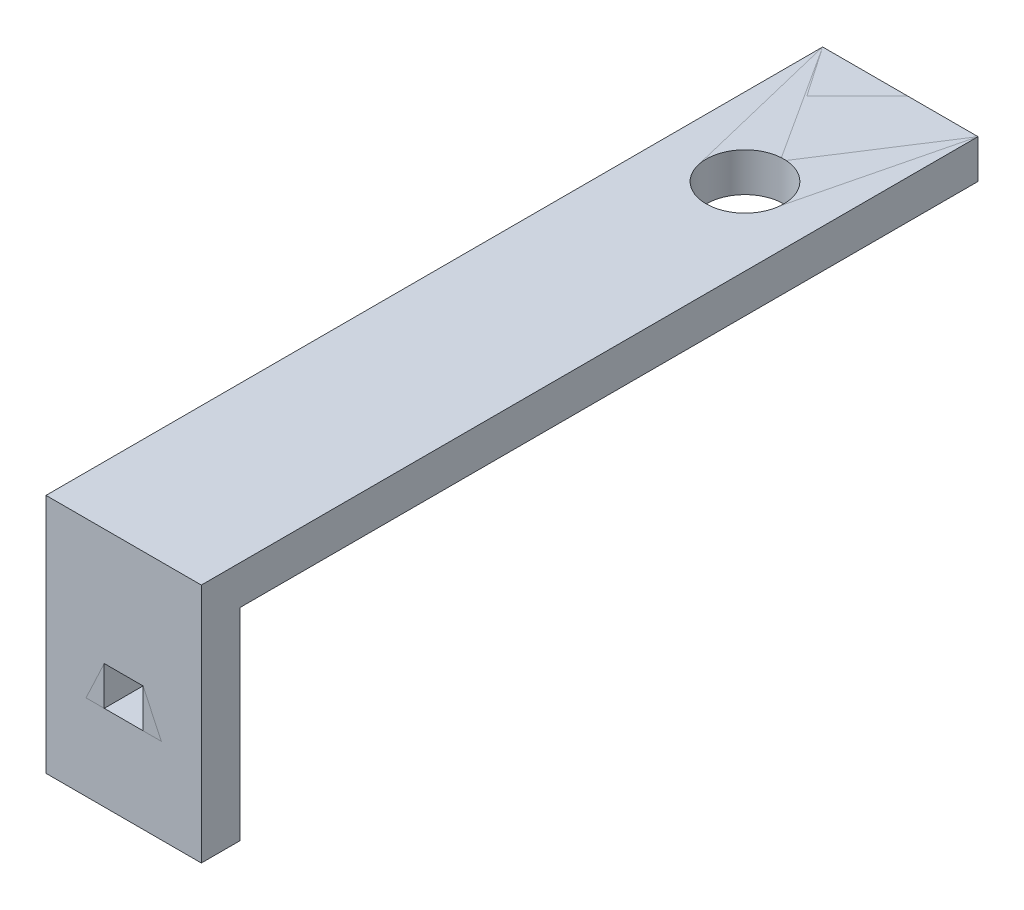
ISO-10303-21;
HEADER;
FILE_DESCRIPTION(('STEP AP214'),'2;1');
FILE_NAME('part.step','',(''),(''),'','','');
FILE_SCHEMA(('AUTOMOTIVE_DESIGN { 1 0 10303 214 1 1 1 1 }'));
ENDSEC;
DATA;
#1=APPLICATION_CONTEXT('core data for automotive mechanical design processes');
#2=APPLICATION_PROTOCOL_DEFINITION('international standard','automotive_design',2000,#1);
#3=PRODUCT_CONTEXT('',#1,'mechanical');
#4=PRODUCT('Part','Part','',(#3));
#5=PRODUCT_RELATED_PRODUCT_CATEGORY('part','',(#4));
#6=PRODUCT_DEFINITION_FORMATION('','',#4);
#7=PRODUCT_DEFINITION_CONTEXT('part definition',#1,'design');
#8=PRODUCT_DEFINITION('design','',#6,#7);
#9=PRODUCT_DEFINITION_SHAPE('','',#8);
#10=(LENGTH_UNIT() NAMED_UNIT(*) SI_UNIT(.MILLI.,.METRE.));
#11=(NAMED_UNIT(*) PLANE_ANGLE_UNIT() SI_UNIT($,.RADIAN.));
#12=(NAMED_UNIT(*) SI_UNIT($,.STERADIAN.) SOLID_ANGLE_UNIT());
#13=UNCERTAINTY_MEASURE_WITH_UNIT(LENGTH_MEASURE(1.E-05),#10,'distance_accuracy_value','');
#14=(GEOMETRIC_REPRESENTATION_CONTEXT(3) GLOBAL_UNCERTAINTY_ASSIGNED_CONTEXT((#13)) GLOBAL_UNIT_ASSIGNED_CONTEXT((#10,
#11,#12)) REPRESENTATION_CONTEXT('',''));
#15=CARTESIAN_POINT('',(0.,0.,0.));
#16=DIRECTION('',(0.,0.,1.));
#17=DIRECTION('',(1.,0.,0.));
#18=AXIS2_PLACEMENT_3D('',#15,#16,#17);
#19=CARTESIAN_POINT('',(0.,8.30815280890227,24.1608223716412));
#20=DIRECTION('',(0.,0.,-1.));
#21=DIRECTION('',(-1.,0.,0.));
#22=AXIS2_PLACEMENT_3D('',#19,#20,#21);
#23=PLANE('',#22);
#24=DIRECTION('',(0.,1.,0.));
#25=VECTOR('',#24,1.);
#26=CARTESIAN_POINT('',(10.,9.24565280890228,24.1608223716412));
#27=LINE('',#26,#25);
#28=CARTESIAN_POINT('',(10.,-17.6910613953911,24.1608223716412));
#29=VERTEX_POINT('',#28);
#30=CARTESIAN_POINT('',(10.,8.30815280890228,24.1608223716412));
#31=VERTEX_POINT('',#30);
#32=EDGE_CURVE('P0_E134',#29,#31,#27,.T.);
#33=ORIENTED_EDGE('',*,*,#32,.F.);
#34=DIRECTION('',(1.,0.,0.));
#35=VECTOR('',#34,1.);
#36=CARTESIAN_POINT('',(-10.,-17.6910613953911,24.1608223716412));
#37=LINE('',#36,#35);
#38=CARTESIAN_POINT('',(-10.,-17.6910613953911,24.1608223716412));
#39=VERTEX_POINT('',#38);
#40=EDGE_CURVE('P0_E131',#39,#29,#37,.T.);
#41=ORIENTED_EDGE('',*,*,#40,.F.);
#42=DIRECTION('',(0.,1.,0.));
#43=VECTOR('',#42,1.);
#44=CARTESIAN_POINT('',(-10.,9.24565280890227,24.1608223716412));
#45=LINE('',#44,#43);
#46=CARTESIAN_POINT('',(-10.,8.30815280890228,24.1608223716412));
#47=VERTEX_POINT('',#46);
#48=EDGE_CURVE('P0_E120',#39,#47,#45,.T.);
#49=ORIENTED_EDGE('',*,*,#48,.T.);
#50=DIRECTION('',(1.,0.,0.));
#51=VECTOR('',#50,1.);
#52=CARTESIAN_POINT('',(0.,8.30815280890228,24.1608223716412));
#53=LINE('',#52,#51);
#54=EDGE_CURVE('P0_E164',#31,#47,#53,.F.);
#55=ORIENTED_EDGE('',*,*,#54,.F.);
#56=EDGE_LOOP('',(#33,#41,#49,#55));
#57=FACE_BOUND('',#56,.T.);
#58=DIRECTION('',(0.,1.,0.));
#59=VECTOR('',#58,1.);
#60=CARTESIAN_POINT('',(2.5,-6.69184719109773,24.1608223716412));
#61=LINE('',#60,#59);
#62=CARTESIAN_POINT('',(2.5,-6.69184719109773,24.1608223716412));
#63=VERTEX_POINT('',#62);
#64=CARTESIAN_POINT('',(2.5,-1.69184719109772,24.1608223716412));
#65=VERTEX_POINT('',#64);
#66=EDGE_CURVE('P0_E156',#63,#65,#61,.T.);
#67=ORIENTED_EDGE('',*,*,#66,.T.);
#68=DIRECTION('',(1.,0.,0.));
#69=VECTOR('',#68,1.);
#70=CARTESIAN_POINT('',(2.5,-1.69184719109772,24.1608223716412));
#71=LINE('',#70,#69);
#72=CARTESIAN_POINT('',(-2.5,-1.69184719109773,24.1608223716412));
#73=VERTEX_POINT('',#72);
#74=EDGE_CURVE('P0_E152',#65,#73,#71,.F.);
#75=ORIENTED_EDGE('',*,*,#74,.T.);
#76=DIRECTION('',(0.,1.,0.));
#77=VECTOR('',#76,1.);
#78=CARTESIAN_POINT('',(-2.5,-1.69184719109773,24.1608223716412));
#79=LINE('',#78,#77);
#80=CARTESIAN_POINT('',(-2.5,-6.69184719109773,24.1608223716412));
#81=VERTEX_POINT('',#80);
#82=EDGE_CURVE('P0_E147',#73,#81,#79,.F.);
#83=ORIENTED_EDGE('',*,*,#82,.T.);
#84=DIRECTION('',(-1.,0.,0.));
#85=VECTOR('',#84,1.);
#86=CARTESIAN_POINT('',(10.,-6.69184719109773,24.1608223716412));
#87=LINE('',#86,#85);
#88=EDGE_CURVE('P0_E151',#63,#81,#87,.T.);
#89=ORIENTED_EDGE('',*,*,#88,.F.);
#90=EDGE_LOOP('',(#67,#75,#83,#89));
#91=FACE_BOUND('',#90,.T.);
#92=ADVANCED_FACE('P0_F28',(#57,#91),#23,.T.);
#93=CARTESIAN_POINT('',(-2.5,-1.69184719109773,29.1608223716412));
#94=DIRECTION('',(-1.,0.,0.));
#95=DIRECTION('',(0.,0.,1.));
#96=AXIS2_PLACEMENT_3D('',#93,#94,#95);
#97=PLANE('',#96);
#98=DIRECTION('',(0.,0.,1.));
#99=VECTOR('',#98,1.);
#100=CARTESIAN_POINT('',(-2.5,-1.69184719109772,29.1608223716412));
#101=LINE('',#100,#99);
#102=CARTESIAN_POINT('',(-2.5,-1.69184719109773,29.1608223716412));
#103=VERTEX_POINT('',#102);
#104=EDGE_CURVE('P0_E150',#73,#103,#101,.T.);
#105=ORIENTED_EDGE('',*,*,#104,.T.);
#106=DIRECTION('',(0.,1.,0.));
#107=VECTOR('',#106,1.);
#108=CARTESIAN_POINT('',(-2.5,-6.69184719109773,29.1608223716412));
#109=LINE('',#108,#107);
#110=CARTESIAN_POINT('',(-2.5,-6.69184719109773,29.1608223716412));
#111=VERTEX_POINT('',#110);
#112=EDGE_CURVE('P0_E175',#111,#103,#109,.T.);
#113=ORIENTED_EDGE('',*,*,#112,.F.);
#114=DIRECTION('',(0.,0.,-1.));
#115=VECTOR('',#114,1.);
#116=CARTESIAN_POINT('',(-2.5,-6.69184719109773,24.1608223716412));
#117=LINE('',#116,#115);
#118=EDGE_CURVE('P0_E162',#81,#111,#117,.F.);
#119=ORIENTED_EDGE('',*,*,#118,.F.);
#120=ORIENTED_EDGE('',*,*,#82,.F.);
#121=EDGE_LOOP('',(#105,#113,#119,#120));
#122=FACE_BOUND('',#121,.T.);
#123=ADVANCED_FACE('P0_F223',(#122),#97,.F.);
#124=CARTESIAN_POINT('',(2.5,-1.69184719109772,29.1608223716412));
#125=DIRECTION('',(0.,1.,0.));
#126=DIRECTION('',(0.,0.,1.));
#127=AXIS2_PLACEMENT_3D('',#124,#125,#126);
#128=PLANE('',#127);
#129=DIRECTION('',(0.,0.,-1.));
#130=VECTOR('',#129,1.);
#131=CARTESIAN_POINT('',(2.5,-1.69184719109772,29.1608223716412));
#132=LINE('',#131,#130);
#133=CARTESIAN_POINT('',(2.5,-1.69184719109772,29.1608223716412));
#134=VERTEX_POINT('',#133);
#135=EDGE_CURVE('P0_E68',#65,#134,#132,.F.);
#136=ORIENTED_EDGE('',*,*,#135,.T.);
#137=DIRECTION('',(1.,0.,0.));
#138=VECTOR('',#137,1.);
#139=CARTESIAN_POINT('',(0.,-1.69184719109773,29.1608223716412));
#140=LINE('',#139,#138);
#141=EDGE_CURVE('P0_E182',#103,#134,#140,.T.);
#142=ORIENTED_EDGE('',*,*,#141,.F.);
#143=ORIENTED_EDGE('',*,*,#104,.F.);
#144=ORIENTED_EDGE('',*,*,#74,.F.);
#145=EDGE_LOOP('',(#136,#142,#143,#144));
#146=FACE_BOUND('',#145,.T.);
#147=ADVANCED_FACE('P0_F224',(#146),#128,.F.);
#148=CARTESIAN_POINT('',(2.5,-6.69184719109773,29.1608223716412));
#149=DIRECTION('',(1.,0.,0.));
#150=DIRECTION('',(0.,0.,-1.));
#151=AXIS2_PLACEMENT_3D('',#148,#149,#150);
#152=PLANE('',#151);
#153=DIRECTION('',(0.,0.,-1.));
#154=VECTOR('',#153,1.);
#155=CARTESIAN_POINT('',(2.5,-6.69184719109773,24.1608223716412));
#156=LINE('',#155,#154);
#157=CARTESIAN_POINT('',(2.5,-6.69184719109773,29.1608223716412));
#158=VERTEX_POINT('',#157);
#159=EDGE_CURVE('P0_E159',#158,#63,#156,.T.);
#160=ORIENTED_EDGE('',*,*,#159,.F.);
#161=DIRECTION('',(0.,1.,0.));
#162=VECTOR('',#161,1.);
#163=CARTESIAN_POINT('',(2.5,-6.69184719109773,29.1608223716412));
#164=LINE('',#163,#162);
#165=EDGE_CURVE('P0_E180',#134,#158,#164,.F.);
#166=ORIENTED_EDGE('',*,*,#165,.F.);
#167=ORIENTED_EDGE('',*,*,#135,.F.);
#168=ORIENTED_EDGE('',*,*,#66,.F.);
#169=EDGE_LOOP('',(#160,#166,#167,#168));
#170=FACE_BOUND('',#169,.T.);
#171=ADVANCED_FACE('P0_F226',(#170),#152,.F.);
#172=CARTESIAN_POINT('',(0.,8.30815280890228,-70.8391776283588));
#173=DIRECTION('',(0.,-1.,0.));
#174=DIRECTION('',(0.,0.,-1.));
#175=AXIS2_PLACEMENT_3D('',#172,#173,#174);
#176=PLANE('',#175);
#177=CARTESIAN_POINT('',(0.,8.30815280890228,-50.8391776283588));
#178=DIRECTION('',(0.,1.,0.));
#179=DIRECTION('',(0.,0.,1.));
#180=AXIS2_PLACEMENT_3D('',#177,#178,#179);
#181=CIRCLE('',#180,5.);
#182=CARTESIAN_POINT('',(0.,8.30815280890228,-45.8391776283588));
#183=VERTEX_POINT('',#182);
#184=EDGE_CURVE('P0_E32',#183,#183,#181,.T.);
#185=ORIENTED_EDGE('',*,*,#184,.T.);
#186=EDGE_LOOP('',(#185));
#187=FACE_BOUND('',#186,.T.);
#188=DIRECTION('',(0.,0.,-1.));
#189=VECTOR('',#188,1.);
#190=CARTESIAN_POINT('',(-10.,8.30815280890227,-14.9016776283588));
#191=LINE('',#190,#189);
#192=CARTESIAN_POINT('',(-10.,8.30815280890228,-70.8391776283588));
#193=VERTEX_POINT('',#192);
#194=EDGE_CURVE('P0_E88',#47,#193,#191,.T.);
#195=ORIENTED_EDGE('',*,*,#194,.T.);
#196=DIRECTION('',(-1.,0.,0.));
#197=VECTOR('',#196,1.);
#198=CARTESIAN_POINT('',(0.,8.30815280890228,-70.8391776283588));
#199=LINE('',#198,#197);
#200=CARTESIAN_POINT('',(10.,8.30815280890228,-70.8391776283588));
#201=VERTEX_POINT('',#200);
#202=EDGE_CURVE('P0_E128',#201,#193,#199,.T.);
#203=ORIENTED_EDGE('',*,*,#202,.F.);
#204=DIRECTION('',(0.,0.,-1.));
#205=VECTOR('',#204,1.);
#206=CARTESIAN_POINT('',(10.,8.30815280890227,-14.9016776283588));
#207=LINE('',#206,#205);
#208=EDGE_CURVE('P0_E166',#31,#201,#207,.T.);
#209=ORIENTED_EDGE('',*,*,#208,.F.);
#210=ORIENTED_EDGE('',*,*,#54,.T.);
#211=EDGE_LOOP('',(#195,#203,#209,#210));
#212=FACE_BOUND('',#211,.T.);
#213=ADVANCED_FACE('P0_F198',(#187,#212),#176,.T.);
#214=CARTESIAN_POINT('',(10.,9.24565280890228,-14.9016776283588));
#215=DIRECTION('',(1.,0.,0.));
#216=DIRECTION('',(0.,0.,-1.));
#217=AXIS2_PLACEMENT_3D('',#214,#215,#216);
#218=PLANE('',#217);
#219=DIRECTION('',(0.,1.,0.));
#220=VECTOR('',#219,1.);
#221=CARTESIAN_POINT('',(10.,-6.69184719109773,29.1608223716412));
#222=LINE('',#221,#220);
#223=CARTESIAN_POINT('',(10.,-17.6910613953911,29.1608223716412));
#224=VERTEX_POINT('',#223);
#225=CARTESIAN_POINT('',(10.,13.3081528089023,29.1608223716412));
#226=VERTEX_POINT('',#225);
#227=EDGE_CURVE('P0_E178',#224,#226,#222,.T.);
#228=ORIENTED_EDGE('',*,*,#227,.F.);
#229=DIRECTION('',(0.,0.,1.));
#230=VECTOR('',#229,1.);
#231=CARTESIAN_POINT('',(10.,-17.6910613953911,1.33577662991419));
#232=LINE('',#231,#230);
#233=EDGE_CURVE('P0_E138',#29,#224,#232,.T.);
#234=ORIENTED_EDGE('',*,*,#233,.F.);
#235=ORIENTED_EDGE('',*,*,#32,.T.);
#236=ORIENTED_EDGE('',*,*,#208,.T.);
#237=DIRECTION('',(0.,1.,0.));
#238=VECTOR('',#237,1.);
#239=CARTESIAN_POINT('',(10.,13.3081528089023,-70.8391776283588));
#240=LINE('',#239,#238);
#241=CARTESIAN_POINT('',(10.,13.3081528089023,-70.8391776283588));
#242=VERTEX_POINT('',#241);
#243=EDGE_CURVE('P0_E168',#242,#201,#240,.F.);
#244=ORIENTED_EDGE('',*,*,#243,.F.);
#245=DIRECTION('',(0.,0.,1.));
#246=VECTOR('',#245,1.);
#247=CARTESIAN_POINT('',(10.,13.3081528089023,29.1608223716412));
#248=LINE('',#247,#246);
#249=EDGE_CURVE('P0_E60',#226,#242,#248,.F.);
#250=ORIENTED_EDGE('',*,*,#249,.F.);
#251=EDGE_LOOP('',(#228,#234,#235,#236,#244,#250));
#252=FACE_BOUND('',#251,.T.);
#253=ADVANCED_FACE('P0_F212',(#252),#218,.T.);
#254=CARTESIAN_POINT('',(0.,13.3081528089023,-70.8391776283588));
#255=DIRECTION('',(0.,0.,-1.));
#256=DIRECTION('',(-1.,0.,0.));
#257=AXIS2_PLACEMENT_3D('',#254,#255,#256);
#258=PLANE('',#257);
#259=DIRECTION('',(0.,1.,0.));
#260=VECTOR('',#259,1.);
#261=CARTESIAN_POINT('',(-10.,9.24565280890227,-70.8391776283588));
#262=LINE('',#261,#260);
#263=CARTESIAN_POINT('',(-10.,13.3081528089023,-70.8391776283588));
#264=VERTEX_POINT('',#263);
#265=EDGE_CURVE('P0_E173',#193,#264,#262,.T.);
#266=ORIENTED_EDGE('',*,*,#265,.T.);
#267=DIRECTION('',(1.,0.,0.));
#268=VECTOR('',#267,1.);
#269=CARTESIAN_POINT('',(0.,13.3081528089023,-70.8391776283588));
#270=LINE('',#269,#268);
#271=EDGE_CURVE('P0_E191',#242,#264,#270,.F.);
#272=ORIENTED_EDGE('',*,*,#271,.F.);
#273=ORIENTED_EDGE('',*,*,#243,.T.);
#274=ORIENTED_EDGE('',*,*,#202,.T.);
#275=EDGE_LOOP('',(#266,#272,#273,#274));
#276=FACE_BOUND('',#275,.T.);
#277=ADVANCED_FACE('P0_F210',(#276),#258,.T.);
#278=CARTESIAN_POINT('',(-10.,9.24565280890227,-14.9016776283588));
#279=DIRECTION('',(1.,0.,0.));
#280=DIRECTION('',(0.,0.,-1.));
#281=AXIS2_PLACEMENT_3D('',#278,#279,#280);
#282=PLANE('',#281);
#283=ORIENTED_EDGE('',*,*,#194,.F.);
#284=ORIENTED_EDGE('',*,*,#48,.F.);
#285=DIRECTION('',(0.,0.,1.));
#286=VECTOR('',#285,1.);
#287=CARTESIAN_POINT('',(-10.,-17.6910613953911,1.33577662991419));
#288=LINE('',#287,#286);
#289=CARTESIAN_POINT('',(-10.,-17.6910613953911,29.1608223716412));
#290=VERTEX_POINT('',#289);
#291=EDGE_CURVE('P0_E124',#39,#290,#288,.T.);
#292=ORIENTED_EDGE('',*,*,#291,.T.);
#293=DIRECTION('',(0.,1.,0.));
#294=VECTOR('',#293,1.);
#295=CARTESIAN_POINT('',(-10.,-6.69184719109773,29.1608223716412));
#296=LINE('',#295,#294);
#297=CARTESIAN_POINT('',(-10.,13.3081528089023,29.1608223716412));
#298=VERTEX_POINT('',#297);
#299=EDGE_CURVE('P0_E46',#298,#290,#296,.F.);
#300=ORIENTED_EDGE('',*,*,#299,.F.);
#301=DIRECTION('',(0.,0.,1.));
#302=VECTOR('',#301,1.);
#303=CARTESIAN_POINT('',(-10.,13.3081528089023,29.1608223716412));
#304=LINE('',#303,#302);
#305=EDGE_CURVE('P0_E188',#264,#298,#304,.T.);
#306=ORIENTED_EDGE('',*,*,#305,.F.);
#307=ORIENTED_EDGE('',*,*,#265,.F.);
#308=EDGE_LOOP('',(#283,#284,#292,#300,#306,#307));
#309=FACE_BOUND('',#308,.T.);
#310=ADVANCED_FACE('P0_F122',(#309),#282,.F.);
#311=CARTESIAN_POINT('',(0.,-6.69184719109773,29.1608223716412));
#312=DIRECTION('',(0.,0.,1.));
#313=DIRECTION('',(1.,0.,0.));
#314=AXIS2_PLACEMENT_3D('',#311,#312,#313);
#315=PLANE('',#314);
#316=DIRECTION('',(1.,0.,0.));
#317=VECTOR('',#316,1.);
#318=CARTESIAN_POINT('',(-10.,-17.6910613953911,29.1608223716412));
#319=LINE('',#318,#317);
#320=EDGE_CURVE('P0_E142',#290,#224,#319,.T.);
#321=ORIENTED_EDGE('',*,*,#320,.T.);
#322=ORIENTED_EDGE('',*,*,#227,.T.);
#323=DIRECTION('',(1.,0.,0.));
#324=VECTOR('',#323,1.);
#325=CARTESIAN_POINT('',(0.,13.3081528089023,29.1608223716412));
#326=LINE('',#325,#324);
#327=EDGE_CURVE('P0_E38',#298,#226,#326,.T.);
#328=ORIENTED_EDGE('',*,*,#327,.F.);
#329=ORIENTED_EDGE('',*,*,#299,.T.);
#330=EDGE_LOOP('',(#321,#322,#328,#329));
#331=FACE_BOUND('',#330,.T.);
#332=ORIENTED_EDGE('',*,*,#165,.T.);
#333=DIRECTION('',(-1.,0.,0.));
#334=VECTOR('',#333,1.);
#335=CARTESIAN_POINT('',(10.,-6.69184719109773,29.1608223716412));
#336=LINE('',#335,#334);
#337=EDGE_CURVE('P0_E81',#158,#111,#336,.T.);
#338=ORIENTED_EDGE('',*,*,#337,.T.);
#339=ORIENTED_EDGE('',*,*,#112,.T.);
#340=ORIENTED_EDGE('',*,*,#141,.T.);
#341=EDGE_LOOP('',(#332,#338,#339,#340));
#342=FACE_BOUND('',#341,.T.);
#343=ADVANCED_FACE('P0_F203',(#331,#342),#315,.T.);
#344=CARTESIAN_POINT('',(0.,8.30815280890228,-50.8391776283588));
#345=DIRECTION('',(0.,1.,0.));
#346=DIRECTION('',(0.,0.,1.));
#347=AXIS2_PLACEMENT_3D('',#344,#345,#346);
#348=CYLINDRICAL_SURFACE('',#347,5.);
#349=ORIENTED_EDGE('',*,*,#184,.F.);
#350=EDGE_LOOP('',(#349));
#351=FACE_BOUND('',#350,.T.);
#352=CARTESIAN_POINT('',(0.,13.3081528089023,-50.8391776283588));
#353=DIRECTION('',(0.,1.,0.));
#354=DIRECTION('',(0.,0.,1.));
#355=AXIS2_PLACEMENT_3D('',#352,#353,#354);
#356=CIRCLE('',#355,5.);
#357=CARTESIAN_POINT('',(0.,13.3081528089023,-45.8391776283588));
#358=VERTEX_POINT('',#357);
#359=EDGE_CURVE('P0_E11',#358,#358,#356,.F.);
#360=ORIENTED_EDGE('',*,*,#359,.F.);
#361=EDGE_LOOP('',(#360));
#362=FACE_BOUND('',#361,.T.);
#363=ADVANCED_FACE('P0_F30',(#351,#362),#348,.F.);
#364=CARTESIAN_POINT('',(0.,13.3081528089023,29.1608223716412));
#365=DIRECTION('',(0.,1.,0.));
#366=DIRECTION('',(0.,0.,1.));
#367=AXIS2_PLACEMENT_3D('',#364,#365,#366);
#368=PLANE('',#367);
#369=ORIENTED_EDGE('',*,*,#359,.T.);
#370=EDGE_LOOP('',(#369));
#371=FACE_BOUND('',#370,.T.);
#372=ORIENTED_EDGE('',*,*,#305,.T.);
#373=ORIENTED_EDGE('',*,*,#327,.T.);
#374=ORIENTED_EDGE('',*,*,#249,.T.);
#375=ORIENTED_EDGE('',*,*,#271,.T.);
#376=EDGE_LOOP('',(#372,#373,#374,#375));
#377=FACE_BOUND('',#376,.T.);
#378=ADVANCED_FACE('P0_F202',(#371,#377),#368,.T.);
#379=CARTESIAN_POINT('',(10.,-6.69184719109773,1.33577662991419));
#380=DIRECTION('',(0.,1.,0.));
#381=DIRECTION('',(-1.,0.,0.));
#382=AXIS2_PLACEMENT_3D('',#379,#380,#381);
#383=PLANE('',#382);
#384=ORIENTED_EDGE('',*,*,#118,.T.);
#385=ORIENTED_EDGE('',*,*,#337,.F.);
#386=ORIENTED_EDGE('',*,*,#159,.T.);
#387=ORIENTED_EDGE('',*,*,#88,.T.);
#388=EDGE_LOOP('',(#384,#385,#386,#387));
#389=FACE_BOUND('',#388,.T.);
#390=ADVANCED_FACE('P0_F207',(#389),#383,.T.);
#391=CARTESIAN_POINT('',(-10.,-17.6910613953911,1.33577662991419));
#392=DIRECTION('',(0.,-1.,0.));
#393=DIRECTION('',(0.,0.,-1.));
#394=AXIS2_PLACEMENT_3D('',#391,#392,#393);
#395=PLANE('',#394);
#396=ORIENTED_EDGE('',*,*,#291,.F.);
#397=ORIENTED_EDGE('',*,*,#40,.T.);
#398=ORIENTED_EDGE('',*,*,#233,.T.);
#399=ORIENTED_EDGE('',*,*,#320,.F.);
#400=EDGE_LOOP('',(#396,#397,#398,#399));
#401=FACE_BOUND('',#400,.T.);
#402=ADVANCED_FACE('P0_F140',(#401),#395,.T.);
#403=CLOSED_SHELL('',(#92,#123,#147,#171,#213,#253,#277,#310,#343,#363,#378,#390,#402));
#404=MANIFOLD_SOLID_BREP('P0_B2',#403);
#405=CARTESIAN_POINT('',(0.,8.30815280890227,24.1608223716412));
#406=DIRECTION('',(0.,0.,-1.));
#407=DIRECTION('',(-1.,0.,0.));
#408=AXIS2_PLACEMENT_3D('',#405,#406,#407);
#409=PLANE('',#408);
#410=DIRECTION('',(0.,1.,0.));
#411=VECTOR('',#410,1.);
#412=CARTESIAN_POINT('',(2.5,-6.69184719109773,24.1608223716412));
#413=LINE('',#412,#411);
#414=CARTESIAN_POINT('',(2.5,-6.69184719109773,24.1608223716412));
#415=VERTEX_POINT('',#414);
#416=CARTESIAN_POINT('',(2.5,-1.69184719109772,24.1608223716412));
#417=VERTEX_POINT('',#416);
#418=EDGE_CURVE('P1_E120',#415,#417,#413,.T.);
#419=ORIENTED_EDGE('',*,*,#418,.T.);
#420=DIRECTION('',(1.,0.,0.));
#421=VECTOR('',#420,1.);
#422=CARTESIAN_POINT('',(2.5,-1.69184719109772,24.1608223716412));
#423=LINE('',#422,#421);
#424=CARTESIAN_POINT('',(-2.5,-1.69184719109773,24.1608223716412));
#425=VERTEX_POINT('',#424);
#426=EDGE_CURVE('P1_E118',#417,#425,#423,.F.);
#427=ORIENTED_EDGE('',*,*,#426,.T.);
#428=DIRECTION('',(0.,1.,0.));
#429=VECTOR('',#428,1.);
#430=CARTESIAN_POINT('',(-2.5,-1.69184719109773,24.1608223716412));
#431=LINE('',#430,#429);
#432=CARTESIAN_POINT('',(-2.5,-6.69184719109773,24.1608223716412));
#433=VERTEX_POINT('',#432);
#434=EDGE_CURVE('P1_E106',#425,#433,#431,.F.);
#435=ORIENTED_EDGE('',*,*,#434,.T.);
#436=DIRECTION('',(1.,0.,0.));
#437=VECTOR('',#436,1.);
#438=CARTESIAN_POINT('',(0.,-6.69184719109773,24.1608223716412));
#439=LINE('',#438,#437);
#440=CARTESIAN_POINT('',(-10.,-6.69184719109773,24.1608223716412));
#441=VERTEX_POINT('',#440);
#442=EDGE_CURVE('P1_E138',#441,#433,#439,.T.);
#443=ORIENTED_EDGE('',*,*,#442,.F.);
#444=DIRECTION('',(0.,1.,0.));
#445=VECTOR('',#444,1.);
#446=CARTESIAN_POINT('',(-10.,9.24565280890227,24.1608223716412));
#447=LINE('',#446,#445);
#448=CARTESIAN_POINT('',(-10.,8.30815280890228,24.1608223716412));
#449=VERTEX_POINT('',#448);
#450=EDGE_CURVE('P1_E159',#441,#449,#447,.T.);
#451=ORIENTED_EDGE('',*,*,#450,.T.);
#452=DIRECTION('',(1.,0.,0.));
#453=VECTOR('',#452,1.);
#454=CARTESIAN_POINT('',(0.,8.30815280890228,24.1608223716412));
#455=LINE('',#454,#453);
#456=CARTESIAN_POINT('',(10.,8.30815280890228,24.1608223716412));
#457=VERTEX_POINT('',#456);
#458=EDGE_CURVE('P1_E140',#457,#449,#455,.F.);
#459=ORIENTED_EDGE('',*,*,#458,.F.);
#460=DIRECTION('',(0.,1.,0.));
#461=VECTOR('',#460,1.);
#462=CARTESIAN_POINT('',(10.,9.24565280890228,24.1608223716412));
#463=LINE('',#462,#461);
#464=CARTESIAN_POINT('',(10.,-6.69184719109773,24.1608223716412));
#465=VERTEX_POINT('',#464);
#466=EDGE_CURVE('P1_E143',#465,#457,#463,.T.);
#467=ORIENTED_EDGE('',*,*,#466,.F.);
#468=DIRECTION('',(1.,0.,0.));
#469=VECTOR('',#468,1.);
#470=CARTESIAN_POINT('',(0.,-6.69184719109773,24.1608223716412));
#471=LINE('',#470,#469);
#472=EDGE_CURVE('P1_E133',#415,#465,#471,.T.);
#473=ORIENTED_EDGE('',*,*,#472,.F.);
#474=EDGE_LOOP('',(#419,#427,#435,#443,#451,#459,#467,#473));
#475=FACE_BOUND('',#474,.T.);
#476=ADVANCED_FACE('P1_F15',(#475),#409,.T.);
#477=CARTESIAN_POINT('',(-2.5,-1.69184719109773,29.1608223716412));
#478=DIRECTION('',(-1.,0.,0.));
#479=DIRECTION('',(0.,0.,1.));
#480=AXIS2_PLACEMENT_3D('',#477,#478,#479);
#481=PLANE('',#480);
#482=DIRECTION('',(0.,0.,1.));
#483=VECTOR('',#482,1.);
#484=CARTESIAN_POINT('',(-2.5,-1.69184719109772,29.1608223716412));
#485=LINE('',#484,#483);
#486=CARTESIAN_POINT('',(-2.5,-1.69184719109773,29.1608223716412));
#487=VERTEX_POINT('',#486);
#488=EDGE_CURVE('P1_E110',#425,#487,#485,.T.);
#489=ORIENTED_EDGE('',*,*,#488,.T.);
#490=DIRECTION('',(0.,1.,0.));
#491=VECTOR('',#490,1.);
#492=CARTESIAN_POINT('',(-2.5,-6.69184719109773,29.1608223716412));
#493=LINE('',#492,#491);
#494=CARTESIAN_POINT('',(-2.5,-6.69184719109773,29.1608223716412));
#495=VERTEX_POINT('',#494);
#496=EDGE_CURVE('P1_E73',#495,#487,#493,.T.);
#497=ORIENTED_EDGE('',*,*,#496,.F.);
#498=DIRECTION('',(0.,0.,-1.));
#499=VECTOR('',#498,1.);
#500=CARTESIAN_POINT('',(-2.5,-6.69184719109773,24.1608223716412));
#501=LINE('',#500,#499);
#502=EDGE_CURVE('P1_E112',#433,#495,#501,.F.);
#503=ORIENTED_EDGE('',*,*,#502,.F.);
#504=ORIENTED_EDGE('',*,*,#434,.F.);
#505=EDGE_LOOP('',(#489,#497,#503,#504));
#506=FACE_BOUND('',#505,.T.);
#507=ADVANCED_FACE('P1_F108',(#506),#481,.F.);
#508=CARTESIAN_POINT('',(2.5,-1.69184719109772,29.1608223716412));
#509=DIRECTION('',(0.,1.,0.));
#510=DIRECTION('',(0.,0.,1.));
#511=AXIS2_PLACEMENT_3D('',#508,#509,#510);
#512=PLANE('',#511);
#513=DIRECTION('',(0.,0.,-1.));
#514=VECTOR('',#513,1.);
#515=CARTESIAN_POINT('',(2.5,-1.69184719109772,29.1608223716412));
#516=LINE('',#515,#514);
#517=CARTESIAN_POINT('',(2.5,-1.69184719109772,29.1608223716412));
#518=VERTEX_POINT('',#517);
#519=EDGE_CURVE('P1_E123',#417,#518,#516,.F.);
#520=ORIENTED_EDGE('',*,*,#519,.T.);
#521=DIRECTION('',(1.,0.,0.));
#522=VECTOR('',#521,1.);
#523=CARTESIAN_POINT('',(0.,-1.69184719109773,29.1608223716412));
#524=LINE('',#523,#522);
#525=EDGE_CURVE('P1_E127',#487,#518,#524,.T.);
#526=ORIENTED_EDGE('',*,*,#525,.F.);
#527=ORIENTED_EDGE('',*,*,#488,.F.);
#528=ORIENTED_EDGE('',*,*,#426,.F.);
#529=EDGE_LOOP('',(#520,#526,#527,#528));
#530=FACE_BOUND('',#529,.T.);
#531=ADVANCED_FACE('P1_F125',(#530),#512,.F.);
#532=CARTESIAN_POINT('',(2.5,-6.69184719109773,29.1608223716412));
#533=DIRECTION('',(1.,0.,0.));
#534=DIRECTION('',(0.,0.,-1.));
#535=AXIS2_PLACEMENT_3D('',#532,#533,#534);
#536=PLANE('',#535);
#537=DIRECTION('',(0.,0.,-1.));
#538=VECTOR('',#537,1.);
#539=CARTESIAN_POINT('',(2.5,-6.69184719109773,24.1608223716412));
#540=LINE('',#539,#538);
#541=CARTESIAN_POINT('',(2.5,-6.69184719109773,29.1608223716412));
#542=VERTEX_POINT('',#541);
#543=EDGE_CURVE('P1_E131',#542,#415,#540,.T.);
#544=ORIENTED_EDGE('',*,*,#543,.F.);
#545=DIRECTION('',(0.,1.,0.));
#546=VECTOR('',#545,1.);
#547=CARTESIAN_POINT('',(2.5,-6.69184719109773,29.1608223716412));
#548=LINE('',#547,#546);
#549=EDGE_CURVE('P1_E171',#518,#542,#548,.F.);
#550=ORIENTED_EDGE('',*,*,#549,.F.);
#551=ORIENTED_EDGE('',*,*,#519,.F.);
#552=ORIENTED_EDGE('',*,*,#418,.F.);
#553=EDGE_LOOP('',(#544,#550,#551,#552));
#554=FACE_BOUND('',#553,.T.);
#555=ADVANCED_FACE('P1_F209',(#554),#536,.F.);
#556=CARTESIAN_POINT('',(0.,-6.69184719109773,24.1608223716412));
#557=DIRECTION('',(0.,-1.,0.));
#558=DIRECTION('',(0.,0.,-1.));
#559=AXIS2_PLACEMENT_3D('',#556,#557,#558);
#560=PLANE('',#559);
#561=DIRECTION('',(0.,0.,-1.));
#562=VECTOR('',#561,1.);
#563=CARTESIAN_POINT('',(10.,-6.69184719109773,-14.9016776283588));
#564=LINE('',#563,#562);
#565=CARTESIAN_POINT('',(10.,-6.69184719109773,29.1608223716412));
#566=VERTEX_POINT('',#565);
#567=EDGE_CURVE('P1_E144',#566,#465,#564,.T.);
#568=ORIENTED_EDGE('',*,*,#567,.F.);
#569=DIRECTION('',(1.,0.,0.));
#570=VECTOR('',#569,1.);
#571=CARTESIAN_POINT('',(0.,-6.69184719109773,29.1608223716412));
#572=LINE('',#571,#570);
#573=EDGE_CURVE('P1_E168',#542,#566,#572,.T.);
#574=ORIENTED_EDGE('',*,*,#573,.F.);
#575=ORIENTED_EDGE('',*,*,#543,.T.);
#576=ORIENTED_EDGE('',*,*,#472,.T.);
#577=EDGE_LOOP('',(#568,#574,#575,#576));
#578=FACE_BOUND('',#577,.T.);
#579=ADVANCED_FACE('P1_F205',(#578),#560,.T.);
#580=CARTESIAN_POINT('',(0.,-6.69184719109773,24.1608223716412));
#581=DIRECTION('',(0.,-1.,0.));
#582=DIRECTION('',(0.,0.,-1.));
#583=AXIS2_PLACEMENT_3D('',#580,#581,#582);
#584=PLANE('',#583);
#585=DIRECTION('',(0.,0.,-1.));
#586=VECTOR('',#585,1.);
#587=CARTESIAN_POINT('',(-10.,-6.69184719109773,-14.9016776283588));
#588=LINE('',#587,#586);
#589=CARTESIAN_POINT('',(-10.,-6.69184719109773,29.1608223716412));
#590=VERTEX_POINT('',#589);
#591=EDGE_CURVE('P1_E53',#590,#441,#588,.T.);
#592=ORIENTED_EDGE('',*,*,#591,.T.);
#593=ORIENTED_EDGE('',*,*,#442,.T.);
#594=ORIENTED_EDGE('',*,*,#502,.T.);
#595=DIRECTION('',(1.,0.,0.));
#596=VECTOR('',#595,1.);
#597=CARTESIAN_POINT('',(0.,-6.69184719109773,29.1608223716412));
#598=LINE('',#597,#596);
#599=EDGE_CURVE('P1_E162',#590,#495,#598,.T.);
#600=ORIENTED_EDGE('',*,*,#599,.F.);
#601=EDGE_LOOP('',(#592,#593,#594,#600));
#602=FACE_BOUND('',#601,.T.);
#603=ADVANCED_FACE('P1_F212',(#602),#584,.T.);
#604=CARTESIAN_POINT('',(0.,8.30815280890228,-70.8391776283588));
#605=DIRECTION('',(0.,-1.,0.));
#606=DIRECTION('',(0.,0.,-1.));
#607=AXIS2_PLACEMENT_3D('',#604,#605,#606);
#608=PLANE('',#607);
#609=CARTESIAN_POINT('',(0.,8.30815280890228,-50.8391776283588));
#610=DIRECTION('',(0.,1.,0.));
#611=DIRECTION('',(0.,0.,1.));
#612=AXIS2_PLACEMENT_3D('',#609,#610,#611);
#613=CIRCLE('',#612,5.);
#614=CARTESIAN_POINT('',(0.,8.30815280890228,-45.8391776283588));
#615=VERTEX_POINT('',#614);
#616=EDGE_CURVE('P1_E19',#615,#615,#613,.T.);
#617=ORIENTED_EDGE('',*,*,#616,.T.);
#618=EDGE_LOOP('',(#617));
#619=FACE_BOUND('',#618,.T.);
#620=DIRECTION('',(0.,0.,-1.));
#621=VECTOR('',#620,1.);
#622=CARTESIAN_POINT('',(-10.,8.30815280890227,-14.9016776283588));
#623=LINE('',#622,#621);
#624=CARTESIAN_POINT('',(-10.,8.30815280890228,-70.8391776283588));
#625=VERTEX_POINT('',#624);
#626=EDGE_CURVE('P1_E82',#449,#625,#623,.T.);
#627=ORIENTED_EDGE('',*,*,#626,.T.);
#628=DIRECTION('',(-1.,0.,0.));
#629=VECTOR('',#628,1.);
#630=CARTESIAN_POINT('',(0.,8.30815280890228,-70.8391776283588));
#631=LINE('',#630,#629);
#632=CARTESIAN_POINT('',(10.,8.30815280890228,-70.8391776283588));
#633=VERTEX_POINT('',#632);
#634=EDGE_CURVE('P1_E152',#633,#625,#631,.T.);
#635=ORIENTED_EDGE('',*,*,#634,.F.);
#636=DIRECTION('',(0.,0.,-1.));
#637=VECTOR('',#636,1.);
#638=CARTESIAN_POINT('',(10.,8.30815280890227,-14.9016776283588));
#639=LINE('',#638,#637);
#640=EDGE_CURVE('P1_E148',#457,#633,#639,.T.);
#641=ORIENTED_EDGE('',*,*,#640,.F.);
#642=ORIENTED_EDGE('',*,*,#458,.T.);
#643=EDGE_LOOP('',(#627,#635,#641,#642));
#644=FACE_BOUND('',#643,.T.);
#645=ADVANCED_FACE('P1_F188',(#619,#644),#608,.T.);
#646=CARTESIAN_POINT('',(10.,9.24565280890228,-14.9016776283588));
#647=DIRECTION('',(1.,0.,0.));
#648=DIRECTION('',(0.,0.,-1.));
#649=AXIS2_PLACEMENT_3D('',#646,#647,#648);
#650=PLANE('',#649);
#651=DIRECTION('',(0.,1.,0.));
#652=VECTOR('',#651,1.);
#653=CARTESIAN_POINT('',(10.,-6.69184719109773,29.1608223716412));
#654=LINE('',#653,#652);
#655=CARTESIAN_POINT('',(10.,13.3081528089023,29.1608223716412));
#656=VERTEX_POINT('',#655);
#657=EDGE_CURVE('P1_E166',#566,#656,#654,.T.);
#658=ORIENTED_EDGE('',*,*,#657,.F.);
#659=ORIENTED_EDGE('',*,*,#567,.T.);
#660=ORIENTED_EDGE('',*,*,#466,.T.);
#661=ORIENTED_EDGE('',*,*,#640,.T.);
#662=DIRECTION('',(0.,1.,0.));
#663=VECTOR('',#662,1.);
#664=CARTESIAN_POINT('',(10.,13.3081528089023,-70.8391776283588));
#665=LINE('',#664,#663);
#666=CARTESIAN_POINT('',(10.,13.3081528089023,-70.8391776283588));
#667=VERTEX_POINT('',#666);
#668=EDGE_CURVE('P1_E147',#667,#633,#665,.F.);
#669=ORIENTED_EDGE('',*,*,#668,.F.);
#670=DIRECTION('',(0.,0.,1.));
#671=VECTOR('',#670,1.);
#672=CARTESIAN_POINT('',(10.,13.3081528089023,29.1608223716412));
#673=LINE('',#672,#671);
#674=EDGE_CURVE('P1_E47',#656,#667,#673,.F.);
#675=ORIENTED_EDGE('',*,*,#674,.F.);
#676=EDGE_LOOP('',(#658,#659,#660,#661,#669,#675));
#677=FACE_BOUND('',#676,.T.);
#678=ADVANCED_FACE('P1_F203',(#677),#650,.T.);
#679=CARTESIAN_POINT('',(0.,13.3081528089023,-70.8391776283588));
#680=DIRECTION('',(0.,0.,-1.));
#681=DIRECTION('',(-1.,0.,0.));
#682=AXIS2_PLACEMENT_3D('',#679,#680,#681);
#683=PLANE('',#682);
#684=DIRECTION('',(0.,1.,0.));
#685=VECTOR('',#684,1.);
#686=CARTESIAN_POINT('',(-10.,9.24565280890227,-70.8391776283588));
#687=LINE('',#686,#685);
#688=CARTESIAN_POINT('',(-10.,13.3081528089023,-70.8391776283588));
#689=VERTEX_POINT('',#688);
#690=EDGE_CURVE('P1_E156',#625,#689,#687,.T.);
#691=ORIENTED_EDGE('',*,*,#690,.T.);
#692=DIRECTION('',(1.,0.,0.));
#693=VECTOR('',#692,1.);
#694=CARTESIAN_POINT('',(0.,13.3081528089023,-70.8391776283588));
#695=LINE('',#694,#693);
#696=EDGE_CURVE('P1_E181',#667,#689,#695,.F.);
#697=ORIENTED_EDGE('',*,*,#696,.F.);
#698=ORIENTED_EDGE('',*,*,#668,.T.);
#699=ORIENTED_EDGE('',*,*,#634,.T.);
#700=EDGE_LOOP('',(#691,#697,#698,#699));
#701=FACE_BOUND('',#700,.T.);
#702=ADVANCED_FACE('P1_F201',(#701),#683,.T.);
#703=CARTESIAN_POINT('',(-10.,9.24565280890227,-14.9016776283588));
#704=DIRECTION('',(1.,0.,0.));
#705=DIRECTION('',(0.,0.,-1.));
#706=AXIS2_PLACEMENT_3D('',#703,#704,#705);
#707=PLANE('',#706);
#708=ORIENTED_EDGE('',*,*,#626,.F.);
#709=ORIENTED_EDGE('',*,*,#450,.F.);
#710=ORIENTED_EDGE('',*,*,#591,.F.);
#711=DIRECTION('',(0.,1.,0.));
#712=VECTOR('',#711,1.);
#713=CARTESIAN_POINT('',(-10.,-6.69184719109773,29.1608223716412));
#714=LINE('',#713,#712);
#715=CARTESIAN_POINT('',(-10.,13.3081528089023,29.1608223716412));
#716=VERTEX_POINT('',#715);
#717=EDGE_CURVE('P1_E33',#716,#590,#714,.F.);
#718=ORIENTED_EDGE('',*,*,#717,.F.);
#719=DIRECTION('',(0.,0.,1.));
#720=VECTOR('',#719,1.);
#721=CARTESIAN_POINT('',(-10.,13.3081528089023,29.1608223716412));
#722=LINE('',#721,#720);
#723=EDGE_CURVE('P1_E178',#689,#716,#722,.T.);
#724=ORIENTED_EDGE('',*,*,#723,.F.);
#725=ORIENTED_EDGE('',*,*,#690,.F.);
#726=EDGE_LOOP('',(#708,#709,#710,#718,#724,#725));
#727=FACE_BOUND('',#726,.T.);
#728=ADVANCED_FACE('P1_F199',(#727),#707,.F.);
#729=CARTESIAN_POINT('',(0.,-6.69184719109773,29.1608223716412));
#730=DIRECTION('',(0.,0.,1.));
#731=DIRECTION('',(1.,0.,0.));
#732=AXIS2_PLACEMENT_3D('',#729,#730,#731);
#733=PLANE('',#732);
#734=ORIENTED_EDGE('',*,*,#717,.T.);
#735=ORIENTED_EDGE('',*,*,#599,.T.);
#736=ORIENTED_EDGE('',*,*,#496,.T.);
#737=ORIENTED_EDGE('',*,*,#525,.T.);
#738=ORIENTED_EDGE('',*,*,#549,.T.);
#739=ORIENTED_EDGE('',*,*,#573,.T.);
#740=ORIENTED_EDGE('',*,*,#657,.T.);
#741=DIRECTION('',(1.,0.,0.));
#742=VECTOR('',#741,1.);
#743=CARTESIAN_POINT('',(0.,13.3081528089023,29.1608223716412));
#744=LINE('',#743,#742);
#745=EDGE_CURVE('P1_E25',#716,#656,#744,.T.);
#746=ORIENTED_EDGE('',*,*,#745,.F.);
#747=EDGE_LOOP('',(#734,#735,#736,#737,#738,#739,#740,#746));
#748=FACE_BOUND('',#747,.T.);
#749=ADVANCED_FACE('P1_F193',(#748),#733,.T.);
#750=CARTESIAN_POINT('',(0.,8.30815280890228,-50.8391776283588));
#751=DIRECTION('',(0.,1.,0.));
#752=DIRECTION('',(0.,0.,1.));
#753=AXIS2_PLACEMENT_3D('',#750,#751,#752);
#754=CYLINDRICAL_SURFACE('',#753,5.);
#755=ORIENTED_EDGE('',*,*,#616,.F.);
#756=EDGE_LOOP('',(#755));
#757=FACE_BOUND('',#756,.T.);
#758=CARTESIAN_POINT('',(0.,13.3081528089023,-50.8391776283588));
#759=DIRECTION('',(0.,1.,0.));
#760=DIRECTION('',(0.,0.,1.));
#761=AXIS2_PLACEMENT_3D('',#758,#759,#760);
#762=CIRCLE('',#761,5.);
#763=CARTESIAN_POINT('',(0.,13.3081528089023,-45.8391776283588));
#764=VERTEX_POINT('',#763);
#765=EDGE_CURVE('P1_E10',#764,#764,#762,.F.);
#766=ORIENTED_EDGE('',*,*,#765,.F.);
#767=EDGE_LOOP('',(#766));
#768=FACE_BOUND('',#767,.T.);
#769=ADVANCED_FACE('P1_F17',(#757,#768),#754,.F.);
#770=CARTESIAN_POINT('',(0.,13.3081528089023,29.1608223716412));
#771=DIRECTION('',(0.,1.,0.));
#772=DIRECTION('',(0.,0.,1.));
#773=AXIS2_PLACEMENT_3D('',#770,#771,#772);
#774=PLANE('',#773);
#775=ORIENTED_EDGE('',*,*,#765,.T.);
#776=EDGE_LOOP('',(#775));
#777=FACE_BOUND('',#776,.T.);
#778=ORIENTED_EDGE('',*,*,#723,.T.);
#779=ORIENTED_EDGE('',*,*,#745,.T.);
#780=ORIENTED_EDGE('',*,*,#674,.T.);
#781=ORIENTED_EDGE('',*,*,#696,.T.);
#782=EDGE_LOOP('',(#778,#779,#780,#781));
#783=FACE_BOUND('',#782,.T.);
#784=ADVANCED_FACE('P1_F192',(#777,#783),#774,.T.);
#785=CLOSED_SHELL('',(#476,#507,#531,#555,#579,#603,#645,#678,#702,#728,#749,#769,#784));
#786=MANIFOLD_SOLID_BREP('P1_B1',#785);
#787=ADVANCED_BREP_SHAPE_REPRESENTATION('',(#18,#404,#786),#14);
#788=SHAPE_DEFINITION_REPRESENTATION(#9,#787);
ENDSEC;
END-ISO-10303-21;
